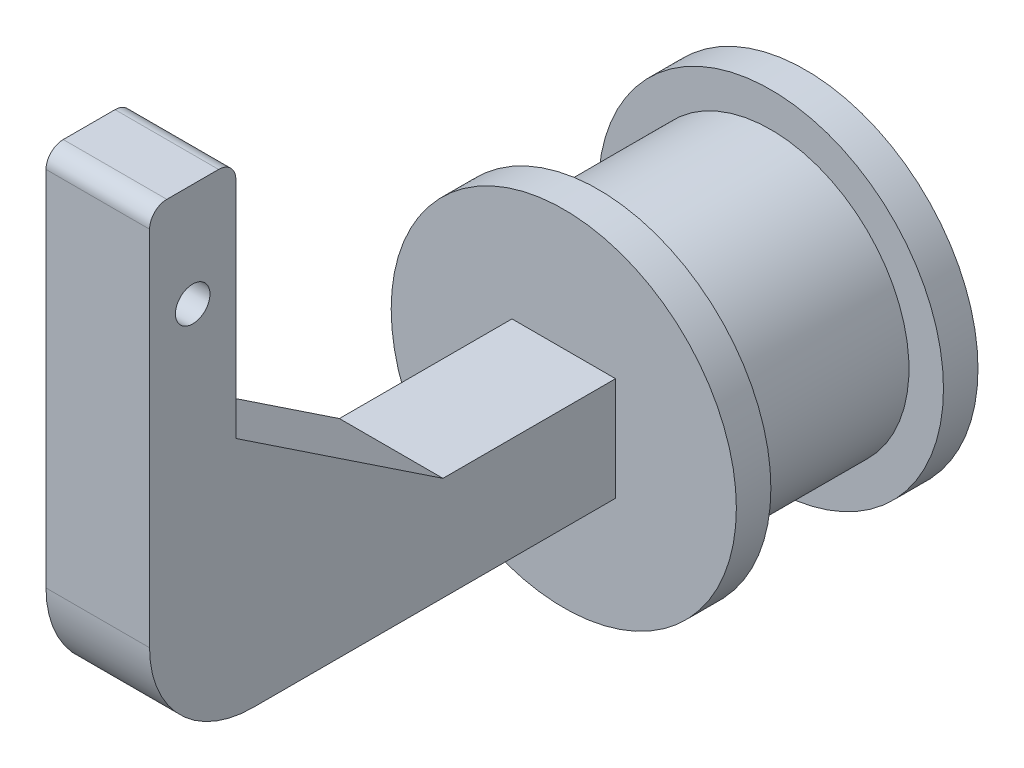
from build123d import *

# Parameters (mm, degrees)
SKETCH1_R           = 40
BOSS_EXTRUDE1_DEPTH = 30
SKETCH3_W           = 30
SKETCH3_H           = 30
BOSS_EXTRUDE2_DEPTH = 120
SKETCH4_W           = 30
SKETCH4_H           = 25
BOSS_EXTRUDE3_DEPTH = 140
SKETCH6_R           = 5
CUT_EXTRUDE1_DEPTH  = 30
BOSS_EXTRUDE4_DEPTH = 30
FILLET2_R           = 30
FILLET3_R           = 5
FILLET4_R           = 5
BOSS_EXTRUDE5_START = 20
SKETCH8_R           = 40
BOSS_EXTRUDE5_DEPTH = 20
SKETCH9_R           = 50
BOSS_EXTRUDE6_DEPTH = 10
BOSS_EXTRUDE7_START = 10
SKETCH10_R          = 50
BOSS_EXTRUDE7_DEPTH = 10


with BuildPart() as part:
    # Sketch1 → Boss-Extrude1 (new body)
    with BuildSketch(Plane.XY):
        Circle(SKETCH1_R)
    extrude(amount=BOSS_EXTRUDE1_DEPTH)

    # Sketch3 → Boss-Extrude2 (add)
    with BuildSketch(Plane.XY.offset(30)):
        Rectangle(SKETCH3_W, SKETCH3_H)
    extrude(amount=BOSS_EXTRUDE2_DEPTH)



with BuildPart() as body_2:
    # Sketch4 → Boss-Extrude3 (new body)
    with BuildSketch(Plane.XZ.offset(15)):
        with Locations((0, 162.5)):
            Rectangle(SKETCH4_W, SKETCH4_H)
    extrude(amount=-BOSS_EXTRUDE3_DEPTH)

    # Sketch6 → Cut-Extrude1 (cut)
    with BuildSketch(Plane.ZY.offset(15)):
        with Locations((162.5, 95)):
            Circle(SKETCH6_R)
    extrude(amount=-CUT_EXTRUDE1_DEPTH, mode=Mode.SUBTRACT)


with BuildPart() as part_1:
    add(part.part)

    add(body_2.part)  # Boss-Extrude4 merges body 2
    # Sketch7 → Boss-Extrude4 (add)
    with BuildSketch(Plane.ZY.offset(15)):
        Polygon((150, 15), (90, 15), (150, 55), align=None)
    extrude(amount=-BOSS_EXTRUDE4_DEPTH)

    # Fillet2
    fillet2_edges = [part_1.edges().sort_by_distance(p)[0] for p in [
        (0, -15, 175),
    ]]
    fillet(fillet2_edges, radius=FILLET2_R)

    # Fillet3
    fillet3_edges = [part_1.edges().sort_by_distance(p)[0] for p in [
        (0, 125, 150),
    ]]
    fillet(fillet3_edges, radius=FILLET3_R)

    # Fillet4
    fillet4_edges = [part_1.edges().sort_by_distance(p)[0] for p in [
        (0, 125, 175),
    ]]
    fillet(fillet4_edges, radius=FILLET4_R)

    # Sketch8 → Boss-Extrude5 (add)
    with BuildSketch(Plane(origin=(0, 0, 0), x_dir=(-1, 0, 0), z_dir=(0, 0, -1)).offset(BOSS_EXTRUDE5_START)):
        Circle(SKETCH8_R)
    extrude(amount=-BOSS_EXTRUDE5_DEPTH)

    # Sketch9 → Boss-Extrude6 (add)
    with BuildSketch(Plane(origin=(0, 0, -20), x_dir=(-1, 0, 0), z_dir=(0, 0, -1))):
        Circle(SKETCH9_R)
    extrude(amount=BOSS_EXTRUDE6_DEPTH)

    # Sketch10 → Boss-Extrude7 (add)
    with BuildSketch(Plane.XY.offset(30).offset(BOSS_EXTRUDE7_START)):
        with Locations(Location((0, 0, 0), (0, 0, 180))):
            Circle(SKETCH10_R)
    extrude(amount=-BOSS_EXTRUDE7_DEPTH)


solid = part_1.part
